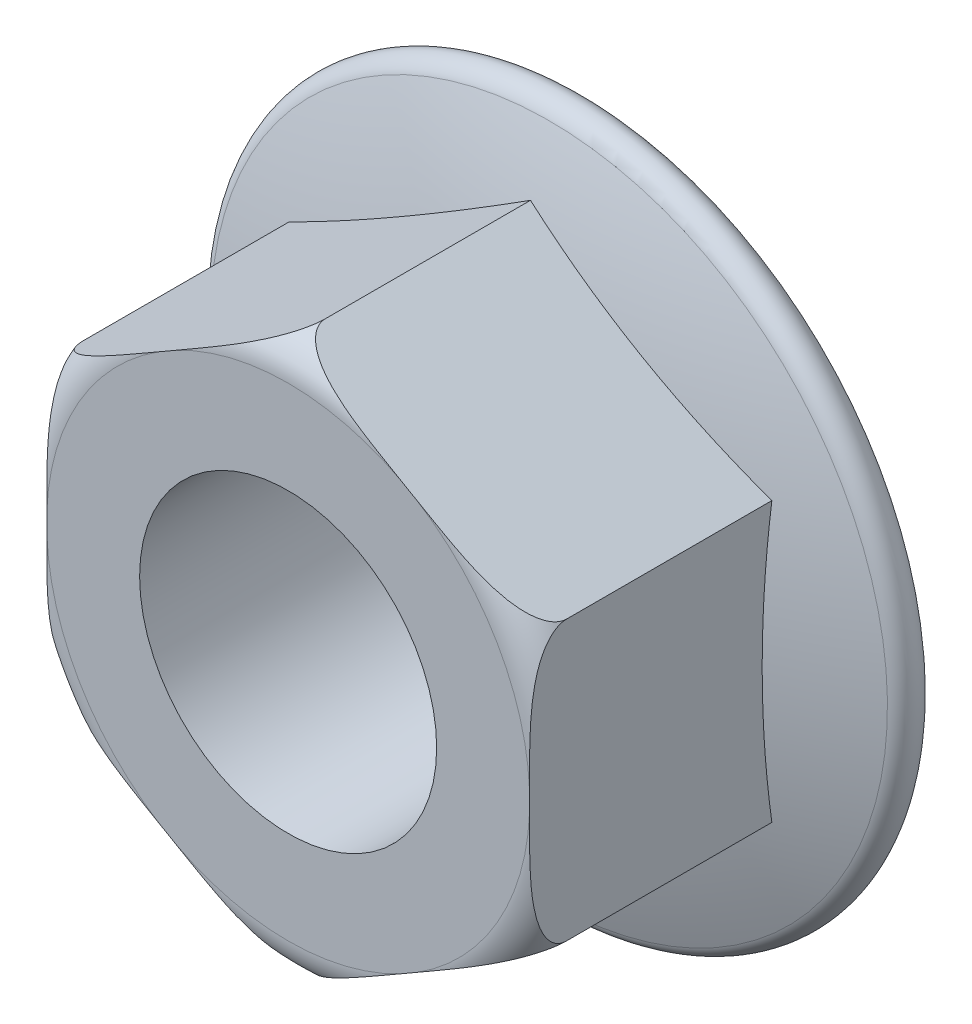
from build123d import *

# Parameters (mm, degrees)
HEAD_DEPTH         = 8
HOLE_SKETCH_R      = 4
THROUGH_HOLE_DEPTH = 16.575782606


with BuildPart() as part:
    # Head Sketch → Head (new body)
    with BuildSketch(Plane.XY):
        Polygon((0, 7.505553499), (6.5, 3.75277675), (6.5, -3.75277675), (0, -7.505553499), (-6.5, -3.75277675), (-6.5, 3.75277675), align=None)
    extrude(amount=HEAD_DEPTH)

    # Flange Sketch → Flange (revolve)
    with BuildSketch(Plane(origin=(0, 0, 0), x_dir=(-1, 0, 0), z_dir=(0, 1, 0)), mode=Mode.PRIVATE) as flange_sk:
        with BuildLine():
            Line((-8.95, 0), (0, 0))
            Line((0, 0), (0, 2.5))
            ThreePointArc((0, 2.5), (-4.620060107, 2.115525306), (-9.11301873, 0.972678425))
            ThreePointArc((-9.11301873, 0.972678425), (-9.443122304, 0.417353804), (-8.95, 0))
        make_face()
    revolve(flange_sk.sketch.rotate(Axis((0, 0, 1.843425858), (0, 0, 1)), 30), axis=Axis((0, 0, 1.843425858), (0, 0, 1)))

    # Sketch5 → Head Trim (revolve, cut)
    with BuildSketch(Plane(origin=(0, 0, 0), x_dir=(0, 0, -1), z_dir=(1, 0, 0)), mode=Mode.PRIVATE) as head_trim_sk:
        with BuildLine():
            Line((-8, -6.505553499), (-8, -7.505553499))
            Line((-8, -7.505553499), (-7, -7.505553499))
            ThreePointArc((-7, -7.505553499), (-7.707106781, -7.212660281), (-8, -6.505553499))
        make_face()
    revolve(head_trim_sk.sketch.rotate(Axis((0, 0, 15.085599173), (0, 0, -1)), 90), axis=Axis((0, 0, 15.085599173), (0, 0, -1)), mode=Mode.SUBTRACT)

    # Hole Sketch → Through Hole (cut, through all)
    with BuildSketch(Plane.XY.offset(8)):
        Circle(HOLE_SKETCH_R)
    extrude(amount=-THROUGH_HOLE_DEPTH, mode=Mode.SUBTRACT)


solid = part.part
